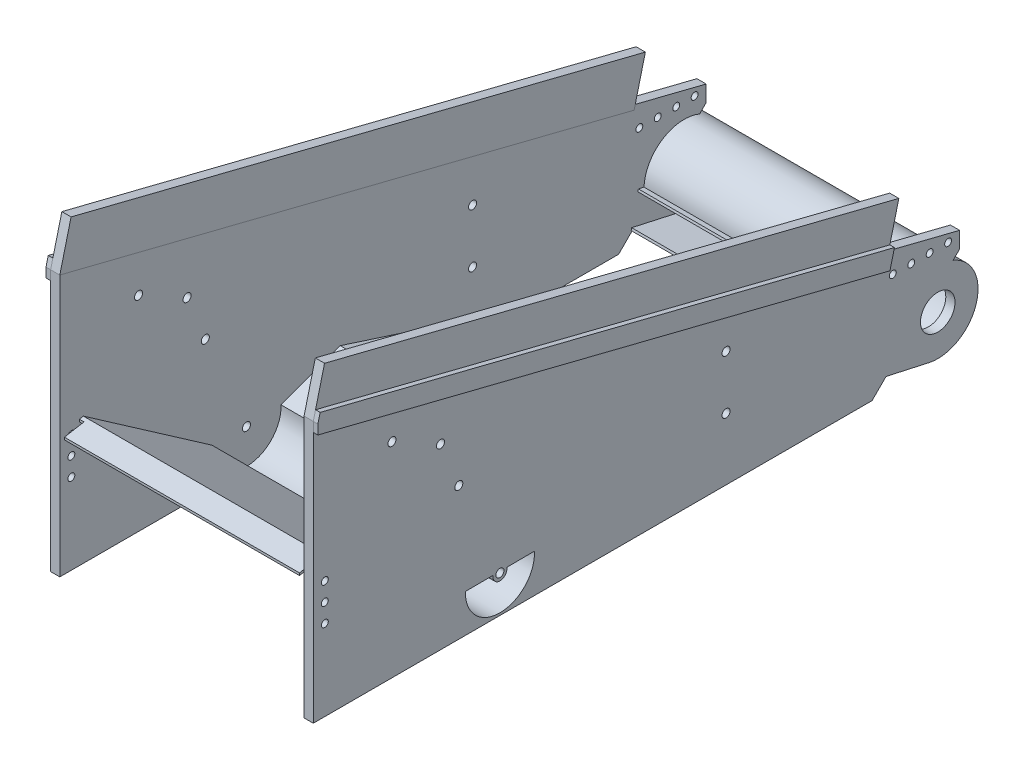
from build123d import *

# Parameters (mm, degrees)
BOSS_EXTRUDE1_START     = 530
SKETCH1_R               = 15
BOSS_EXTRUDE1_DEPTH     = 40
BOSS_EXTRUDE2_START     = -530
SKETCH1_2_R             = 15
BOSS_EXTRUDE2_DEPTH     = 40
CUT_EXTRUDE1_DEPTH      = 1681.71599326
CUT_EXTRUDE1_DEPTH_BACK = 1681.71599326
SKETCH4_W               = 40
SKETCH4_H               = 2569.963095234
BOSS_EXTRUDE5_DEPTH     = 200
BOSS_EXTRUDE5_2_DEPTH   = 200
BOSS_EXTRUDE6_START     = 570
BOSS_EXTRUDE6_DEPTH     = 20
BOSS_EXTRUDE7_START     = -570
BOSS_EXTRUDE7_DEPTH     = 20
SKETCH7_W               = 112.497777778
SKETCH7_H               = 76.010243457
BOSS_EXTRUDE8_DEPTH     = 530
CUT_EXTRUDE2_DEPTH      = 1768.089932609
CUT_EXTRUDE2_DEPTH_BACK = 1768.089932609
SKETCH6_R               = 17.5
CUT_EXTRUDE3_DEPTH      = 1768.089932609
CUT_EXTRUDE3_DEPTH_BACK = 1768.089932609
SKETCH8_W               = 1060
SKETCH8_H               = 112.497777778
BOSS_EXTRUDE9_DEPTH     = 530
SKETCH10_W              = 20
SKETCH10_H              = 85
CUT_EXTRUDE4_DEPTH      = 1768.089932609
SKETCH11_R              = 17.5
CUT_EXTRUDE5_DEPTH      = 1768.089932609
SKETCH11_3_R            = 17.5
CUT_EXTRUDE6_DEPTH      = 1768.089932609
BOSS_EXTRUDE10_DEPTH    = 570
BOSS_EXTRUDE11_START    = 512.532591
BOSS_EXTRUDE11_DEPTH    = 40
BOSS_EXTRUDE12_START    = -587.467409
BOSS_EXTRUDE12_DEPTH    = 40
CUT_EXTRUDE7_DEPTH      = 2086.882745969
CUT_EXTRUDE7_DEPTH_BACK = 2086.882745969
SKETCH14_R              = 75


with BuildPart() as part:
    # Sketch1 → Boss-Extrude1 (new body)
    with BuildSketch(Plane(origin=(0, 0, 0), x_dir=(0, 0, -1), z_dir=(1, 0, 0)).offset(BOSS_EXTRUDE1_START)):
        Polygon((1402.5, -50), (1402.5, 50), (-1302.5, 730), (-1402.5, 730), (-1402.5, -430), (1022.5, -430), align=None)
        with Locations((1352.5, 0)):
            Circle(SKETCH1_R, mode=Mode.SUBTRACT)
        with Locations((-1352.5, 80)):
            Circle(SKETCH1_R, mode=Mode.SUBTRACT)
        with Locations((-1352.5, 0)):
            Circle(SKETCH1_R, mode=Mode.SUBTRACT)
        with Locations((-1352.5, -80)):
            Circle(SKETCH1_R, mode=Mode.SUBTRACT)
        with Locations((1272.5, 0)):
            Circle(SKETCH1_R, mode=Mode.SUBTRACT)
        with Locations((1192.5, 0)):
            Circle(SKETCH1_R, mode=Mode.SUBTRACT)
        with Locations((1112.5, 0)):
            Circle(SKETCH1_R, mode=Mode.SUBTRACT)
    extrude(amount=BOSS_EXTRUDE1_DEPTH)


with BuildPart() as body_2:
    # Sketch1_2 → Boss-Extrude2 (new body)
    with BuildSketch(Plane(origin=(0, 0, 0), x_dir=(0, 0, -1), z_dir=(1, 0, 0)).offset(BOSS_EXTRUDE2_START)):
        Polygon((1402.5, -50), (1402.5, 50), (-1302.5, 730), (-1402.5, 730), (-1402.5, -430), (1022.5, -430), align=None)
        with Locations((1352.5, 0)):
            Circle(SKETCH1_2_R, mode=Mode.SUBTRACT)
        with Locations((-1352.5, 80)):
            Circle(SKETCH1_2_R, mode=Mode.SUBTRACT)
        with Locations((-1352.5, 0)):
            Circle(SKETCH1_2_R, mode=Mode.SUBTRACT)
        with Locations((-1352.5, -80)):
            Circle(SKETCH1_2_R, mode=Mode.SUBTRACT)
        with Locations((1272.5, 0)):
            Circle(SKETCH1_2_R, mode=Mode.SUBTRACT)
        with Locations((1192.5, 0)):
            Circle(SKETCH1_2_R, mode=Mode.SUBTRACT)
        with Locations((1112.5, 0)):
            Circle(SKETCH1_2_R, mode=Mode.SUBTRACT)
    extrude(amount=-BOSS_EXTRUDE2_DEPTH)


with BuildPart() as cut_extrude1_tool:
    # Sketch3 → Cut-Extrude1 (new, two sides: drawn at the far end of the back side and taken through both)
    with BuildSketch(Plane(origin=(0, 0, 0), x_dir=(0, 0, -1), z_dir=(1, 0, 0)).offset(-CUT_EXTRUDE1_DEPTH_BACK)):
        Polygon((1094.791308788, 97.482689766), (1089.91529237, 78.08618328), (-1402.5, 704.645295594), (-1402.5, 730), (-1302.5, 730), (1111.552402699, 123.140246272), (1421.896506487, 45.123983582), (1414.833665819, 17.028418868), align=None)
    extrude(amount=CUT_EXTRUDE1_DEPTH + CUT_EXTRUDE1_DEPTH_BACK)


with BuildPart() as part_1:
    add(part.part)

    # Cut-Extrude1: cut by cut_extrude1_tool
    add(cut_extrude1_tool.part, mode=Mode.SUBTRACT)



with BuildPart() as body_2_1:
    add(body_2.part)

    # Cut-Extrude1: cut by cut_extrude1_tool
    add(cut_extrude1_tool.part, mode=Mode.SUBTRACT)


with BuildPart() as body_3:
    # Sketch4 → Boss-Extrude5 (new body)
    with BuildSketch(Plane(origin=(0, 331.148991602, -83.246326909), x_dir=(1, 0, 0), z_dir=(0, 0.969825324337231, -0.2438008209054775))):
        with Locations((-550, -246.991571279)):
            Rectangle(SKETCH4_W, SKETCH4_H)
    extrude(amount=BOSS_EXTRUDE5_DEPTH)


with BuildPart() as body_4:
    # Sketch4 → Boss-Extrude5 2 (new body)
    with BuildSketch(Plane(origin=(0, 331.148991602, -83.246326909), x_dir=(1, 0, 0), z_dir=(0, 0.969825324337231, -0.2438008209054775))):
        with Locations((550, -246.991571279)):
            Rectangle(SKETCH4_W, SKETCH4_H)
    extrude(amount=BOSS_EXTRUDE5_2_DEPTH)


with BuildPart() as body_5:
    # Sketch5 → Boss-Extrude6 (new body)
    with BuildSketch(Plane(origin=(0, 0, 0), x_dir=(0, 0, -1), z_dir=(1, 0, 0)).offset(BOSS_EXTRUDE6_START)):
        Polygon((-1402.5, 663.400754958), (1080.163259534, 39.293170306), (1099.667325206, 116.879196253), (-1392.747967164, 743.438308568), (-1402.5, 704.645295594), align=None)
    extrude(amount=BOSS_EXTRUDE6_DEPTH)


with BuildPart() as body_6:
    # Sketch5_2 → Boss-Extrude7 (new body)
    with BuildSketch(Plane(origin=(0, 0, 0), x_dir=(0, 0, -1), z_dir=(1, 0, 0)).offset(BOSS_EXTRUDE7_START)):
        Polygon((-1402.5, 663.400754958), (1080.163259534, 39.293170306), (1099.667325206, 116.879196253), (-1392.747967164, 743.438308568), (-1402.5, 704.645295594), align=None)
    extrude(amount=-BOSS_EXTRUDE7_DEPTH)


with BuildPart() as part_2:
    add(part_1.part)

    add(body_2_1.part)  # Boss-Extrude8 merges body 2
    # Sketch7 → Boss-Extrude8 (add, symmetric)
    with BuildSketch(Plane(origin=(0, 0, 0), x_dir=(0, 0, -1), z_dir=(1, 0, 0))):
        with Locations((0, -391.994878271)):
            Rectangle(SKETCH7_W, SKETCH7_H)
    extrude(amount=BOSS_EXTRUDE8_DEPTH, both=True)

    # Sketch6 → Cut-Extrude2 (cut, two sides: drawn at the far end of the back side and taken through both)
    with BuildSketch(Plane(origin=(0, 0, 0), x_dir=(0, 0, -1), z_dir=(1, 0, 0)).offset(-CUT_EXTRUDE2_DEPTH_BACK)):
        with Locations((-1060.896363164, 457.605407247)):
            Circle(SKETCH6_R)
        with Locations((388.725457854, 72.123143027)):
            Circle(SKETCH6_R)
        with Locations((388.725457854, -160.696199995)):
            Circle(SKETCH6_R)
        with Locations((-850.281084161, 343.39392655)):
            Circle(SKETCH6_R)
        with Locations((-770.97199896, 147.689611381)):
            Circle(SKETCH6_R)
    extrude(amount=CUT_EXTRUDE2_DEPTH + CUT_EXTRUDE2_DEPTH_BACK, mode=Mode.SUBTRACT)

    # Sketch8 → Cut-Extrude3 (cut, two sides: drawn at the far end of the back side and taken through both)
    with BuildSketch(Plane(origin=(0, 0, 0), x_dir=(1, 0, 0), z_dir=(0, 1, 0)).offset(-CUT_EXTRUDE3_DEPTH_BACK)):
        Rectangle(SKETCH8_W, SKETCH8_H)
    extrude(amount=CUT_EXTRUDE3_DEPTH + CUT_EXTRUDE3_DEPTH_BACK, mode=Mode.SUBTRACT)


with BuildPart() as cut_extrude3_piece_1:
    # of the separate pieces the step leaves, piece 1, a body of its own (cut_extrude3_pieces)
    add(part_2.part.solids().sort_by_distance((-530, -50, -1402.5))[0])



with BuildPart() as cut_extrude3_piece_2:
    # of the separate pieces the step leaves, piece 2, a body of its own (cut_extrude3_pieces)
    add(part_2.part.solids().sort_by_distance((530, 704.645295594, 1402.5))[0])


with BuildPart() as cut_extrude3_piece_1_1:
    add(cut_extrude3_piece_1.part)

    add(cut_extrude3_piece_2.part)  # Boss-Extrude9 merges Cut-Extrude3 piece 2
    # Sketch9 → Boss-Extrude9 (add, symmetric)
    with BuildSketch(Plane(origin=(0, 0, 0), x_dir=(0, 0, -1), z_dir=(1, 0, 0))):
        with BuildLine():
            Line((-1402.5, 95), (-1302.5, 112.632698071))
            Line((-1302.5, 112.632698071), (-752.5, -270))
            ThreePointArc((-752.5, -270), (-592.5, -430), (-432.5, -270))
            Line((-432.5, -270), (-185.227032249, -180))
            Line((-185.227032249, -180), (589.9213561, -430))
            Line((589.9213561, -430), (622.5, -430))
            Line((622.5, -430), (-185.423028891, -169.429559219))
            Line((-185.423028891, -169.429559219), (-442.660795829, -263.056449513))
            ThreePointArc((-442.660795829, -263.056449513), (-591.609062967, -419.997354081), (-742.411114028, -264.836871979))
            Line((-742.411114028, -264.836871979), (-1300.174765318, 123.196965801))
            Line((-1300.174765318, 123.196965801), (-1402.5, 105.154266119))
            Line((-1402.5, 105.154266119), (-1402.5, 95))
        make_face()
    extrude(amount=BOSS_EXTRUDE9_DEPTH, both=True)

    # Sketch10 → Cut-Extrude4 (cut, through all)
    with BuildSketch(Plane(origin=(0, 0, 0), x_dir=(1, 0, 0), z_dir=(0, 1, 0))):
        with Locations((-520, -1360)):
            Rectangle(SKETCH10_W, SKETCH10_H)
        with Locations((520, -1360)):
            Rectangle(SKETCH10_W, SKETCH10_H)
    extrude(amount=CUT_EXTRUDE4_DEPTH, mode=Mode.SUBTRACT)

    # Sketch11 → Cut-Extrude5 (cut, through all)
    with BuildSketch(Plane(origin=(0, 0, 0), x_dir=(0, 0, -1), z_dir=(1, 0, 0))):
        with Locations((-592.5, -270)):
            Circle(SKETCH11_R)
    extrude(amount=-CUT_EXTRUDE5_DEPTH, mode=Mode.SUBTRACT)

    # Sketch11_3 → Cut-Extrude6 (cut, through all)
    with BuildSketch(Plane(origin=(0, 0, 0), x_dir=(0, 0, -1), z_dir=(1, 0, 0))):
        with Locations((-592.5, -270)):
            Circle(SKETCH11_3_R)
        with BuildLine():
            Line((-742.411114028, -264.836871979), (-621.918353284, -264.121182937))
            ThreePointArc((-621.918353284, -264.121182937), (-592.321812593, -299.999470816), (-563.153556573, -263.772138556))
            Line((-563.153556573, -263.772138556), (-442.660795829, -263.056449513))
            ThreePointArc((-442.660795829, -263.056449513), (-591.609062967, -419.997354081), (-742.411114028, -264.836871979))
        make_face()
    extrude(amount=CUT_EXTRUDE6_DEPTH, mode=Mode.SUBTRACT)

    # Sketch12 → Boss-Extrude10 (add, symmetric)
    with BuildSketch(Plane(origin=(0, 0, 0), x_dir=(0, 0, -1), z_dir=(1, 0, 0))):
        with BuildLine():
            Line((1079.14075817, -358.380094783), (1076.97636203, -368.143054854))
            Line((1076.97636203, -368.143054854), (1269.623067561, -410.851801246))
            ThreePointArc((1269.623067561, -410.851801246), (1446.306583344, -133.427337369), (1132.66225505, -232.465881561))
            Line((1132.66225505, -232.465881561), (1108.254854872, -227.054891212))
            Line((1108.254854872, -227.054891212), (1106.090458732, -236.817851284))
            Line((1106.090458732, -236.817851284), (1142.572946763, -244.90582416))
            ThreePointArc((1142.572946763, -244.90582416), (1434.631211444, -134.820842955), (1271.7874637, -401.088841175))
            Line((1271.7874637, -401.088841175), (1079.14075817, -358.380094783))
        make_face()
    extrude(amount=BOSS_EXTRUDE10_DEPTH, both=True)

    # Sketch13 → Boss-Extrude11 (add)
    with BuildSketch(Plane(origin=(17.467409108, 219.667172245, -4.927747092), x_dir=(0, 0, -1), z_dir=(1, 0, 0)).offset(BOSS_EXTRUDE11_START)):
        with BuildLine():
            Line((1086.473969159, -580.765455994), (1266.859716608, -620.75601342))
            ThreePointArc((1266.859716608, -620.75601342), (1460.581556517, -507.186220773), (1361.637960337, -305.601464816))
            Line((1361.637960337, -305.601464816), (1086.473969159, -580.765455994))
        make_face()
    extrude(amount=BOSS_EXTRUDE11_DEPTH)

    # Sketch13_2 → Boss-Extrude12 (add)
    with BuildSketch(Plane(origin=(17.467409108, 219.667172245, -4.927747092), x_dir=(0, 0, -1), z_dir=(1, 0, 0)).offset(BOSS_EXTRUDE12_START)):
        with BuildLine():
            Line((1086.473969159, -580.765455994), (1266.859716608, -620.75601342))
            ThreePointArc((1266.859716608, -620.75601342), (1460.581556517, -507.186220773), (1361.637960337, -305.601464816))
            Line((1361.637960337, -305.601464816), (1086.473969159, -580.765455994))
        make_face()
    extrude(amount=BOSS_EXTRUDE12_DEPTH)

    # Sketch14 → Cut-Extrude7 (cut, two sides: drawn at the far end of the back side and taken through both)
    with BuildSketch(Plane(origin=(570, 0, 0), x_dir=(0, 0, -1), z_dir=(1, 0, 0)).offset(-CUT_EXTRUDE7_DEPTH_BACK)):
        with Locations((1307.5, -240)):
            Circle(SKETCH14_R)
    extrude(amount=CUT_EXTRUDE7_DEPTH + CUT_EXTRUDE7_DEPTH_BACK, mode=Mode.SUBTRACT)


solid = Compound([body_3.part, body_4.part, body_5.part, body_6.part, cut_extrude3_piece_1_1.part])
